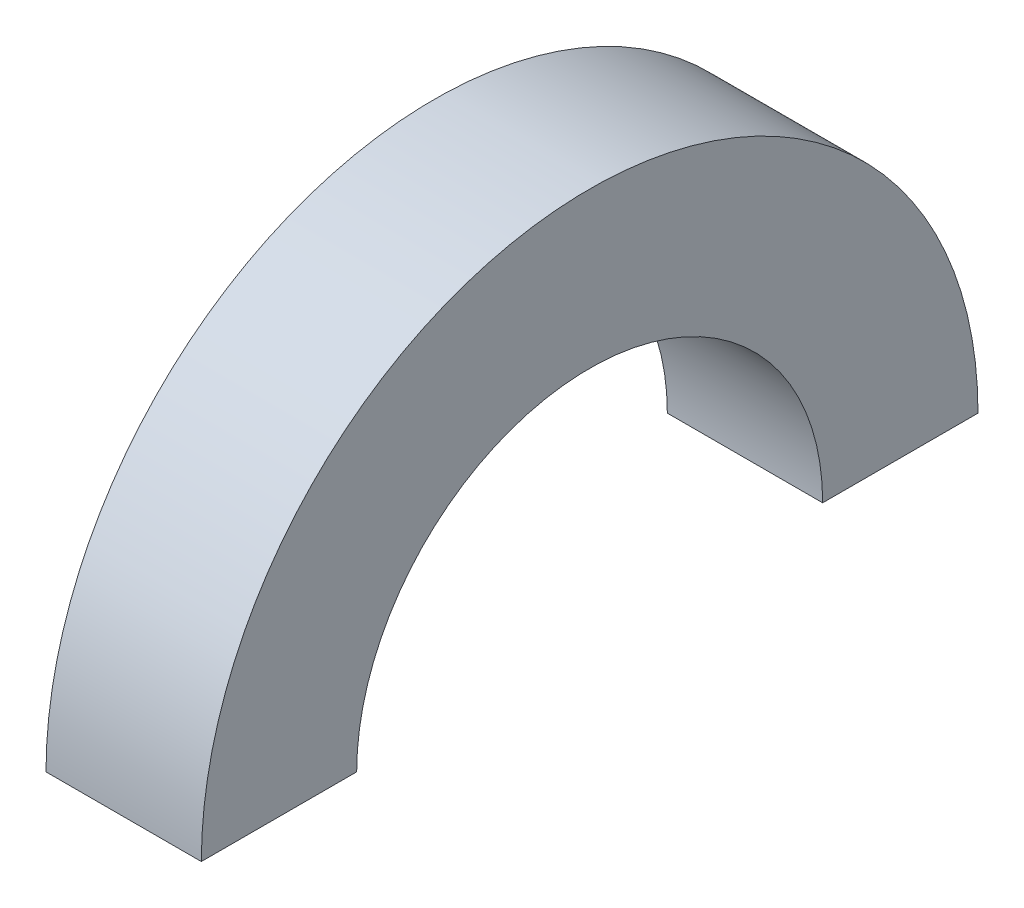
from build123d import *

# Parameters (mm, degrees)
SKETCH3_W = 20
SKETCH3_H = 20


with BuildPart() as part:
    # Sweep1: sweep along a path in Sketch2
    with BuildLine(Plane(origin=(0, 0, 0), x_dir=(0, 0, -1), z_dir=(1, 0, 0))) as sweep1_path:
        ThreePointArc((0, 0), (50, 50), (100, 0))
    # Sketch3 → Sweep1 (sweep)
    with BuildSketch(Plane(origin=(0, 0, 0), x_dir=(1, 0, 0), z_dir=(0, 1, 0))):
        with Locations((10, 10)):
            Rectangle(SKETCH3_W, SKETCH3_H)
    sweep(path=sweep1_path.line)


solid = part.part
